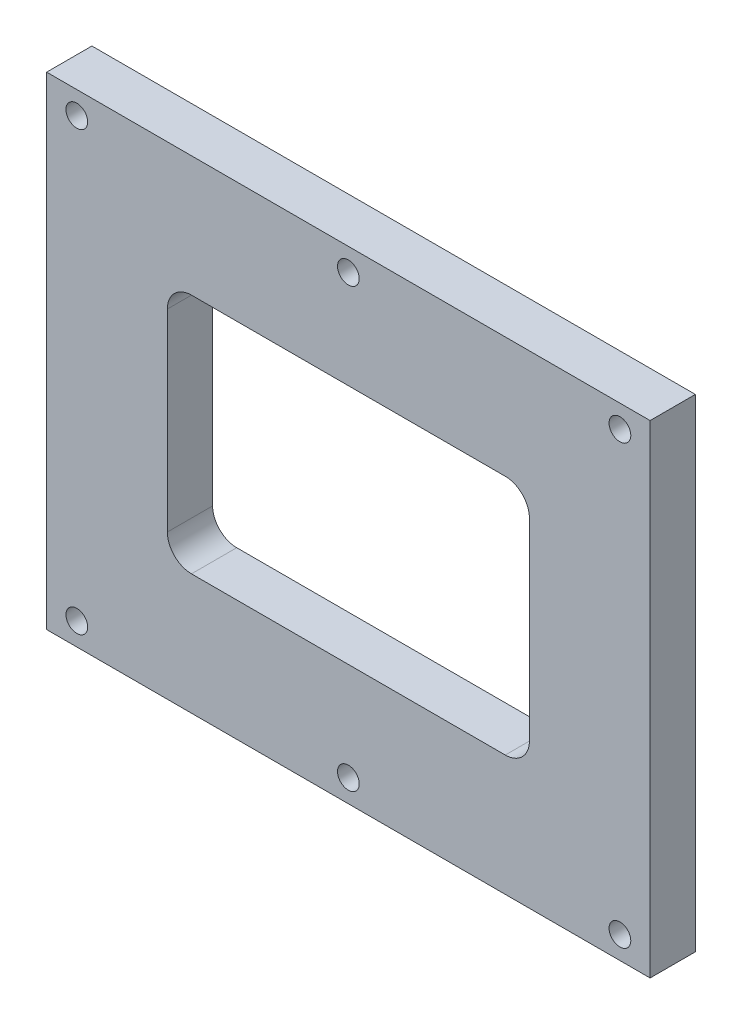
ISO-10303-21;
HEADER;
FILE_DESCRIPTION(('STEP AP214'),'2;1');
FILE_NAME('part.step','',(''),(''),'','','');
FILE_SCHEMA(('AUTOMOTIVE_DESIGN { 1 0 10303 214 1 1 1 1 }'));
ENDSEC;
DATA;
#1=APPLICATION_CONTEXT('core data for automotive mechanical design processes');
#2=APPLICATION_PROTOCOL_DEFINITION('international standard','automotive_design',2000,#1);
#3=PRODUCT_CONTEXT('',#1,'mechanical');
#4=PRODUCT('Part','Part','',(#3));
#5=PRODUCT_RELATED_PRODUCT_CATEGORY('part','',(#4));
#6=PRODUCT_DEFINITION_FORMATION('','',#4);
#7=PRODUCT_DEFINITION_CONTEXT('part definition',#1,'design');
#8=PRODUCT_DEFINITION('design','',#6,#7);
#9=PRODUCT_DEFINITION_SHAPE('','',#8);
#10=(LENGTH_UNIT() NAMED_UNIT(*) SI_UNIT(.MILLI.,.METRE.));
#11=(NAMED_UNIT(*) PLANE_ANGLE_UNIT() SI_UNIT($,.RADIAN.));
#12=(NAMED_UNIT(*) SI_UNIT($,.STERADIAN.) SOLID_ANGLE_UNIT());
#13=UNCERTAINTY_MEASURE_WITH_UNIT(LENGTH_MEASURE(1.E-05),#10,'distance_accuracy_value','');
#14=(GEOMETRIC_REPRESENTATION_CONTEXT(3) GLOBAL_UNCERTAINTY_ASSIGNED_CONTEXT((#13)) GLOBAL_UNIT_ASSIGNED_CONTEXT((#10,
#11,#12)) REPRESENTATION_CONTEXT('',''));
#15=CARTESIAN_POINT('',(0.,0.,0.));
#16=DIRECTION('',(0.,0.,1.));
#17=DIRECTION('',(1.,0.,0.));
#18=AXIS2_PLACEMENT_3D('',#15,#16,#17);
#19=CARTESIAN_POINT('',(31.75,-25.4,4.7625));
#20=DIRECTION('',(-1.,0.,0.));
#21=DIRECTION('',(0.,0.,1.));
#22=AXIS2_PLACEMENT_3D('',#19,#20,#21);
#23=PLANE('',#22);
#24=DIRECTION('',(0.,1.,0.));
#25=VECTOR('',#24,1.);
#26=CARTESIAN_POINT('',(31.75,-25.4,0.));
#27=LINE('',#26,#25);
#28=CARTESIAN_POINT('',(31.75,-25.4,0.));
#29=VERTEX_POINT('',#28);
#30=CARTESIAN_POINT('',(31.75,25.4,0.));
#31=VERTEX_POINT('',#30);
#32=EDGE_CURVE('E144',#29,#31,#27,.T.);
#33=ORIENTED_EDGE('',*,*,#32,.T.);
#34=DIRECTION('',(0.,0.,-1.));
#35=VECTOR('',#34,1.);
#36=CARTESIAN_POINT('',(31.75,25.4,4.7625));
#37=LINE('',#36,#35);
#38=CARTESIAN_POINT('',(31.75,25.4,4.7625));
#39=VERTEX_POINT('',#38);
#40=EDGE_CURVE('E125',#39,#31,#37,.T.);
#41=ORIENTED_EDGE('',*,*,#40,.F.);
#42=DIRECTION('',(0.,1.,0.));
#43=VECTOR('',#42,1.);
#44=CARTESIAN_POINT('',(31.75,-25.4,4.7625));
#45=LINE('',#44,#43);
#46=CARTESIAN_POINT('',(31.75,-25.4,4.7625));
#47=VERTEX_POINT('',#46);
#48=EDGE_CURVE('E132',#47,#39,#45,.T.);
#49=ORIENTED_EDGE('',*,*,#48,.F.);
#50=DIRECTION('',(0.,0.,-1.));
#51=VECTOR('',#50,1.);
#52=CARTESIAN_POINT('',(31.75,-25.4,4.7625));
#53=LINE('',#52,#51);
#54=EDGE_CURVE('E256',#47,#29,#53,.T.);
#55=ORIENTED_EDGE('',*,*,#54,.T.);
#56=EDGE_LOOP('',(#33,#41,#49,#55));
#57=FACE_BOUND('',#56,.T.);
#58=ADVANCED_FACE('F31',(#57),#23,.F.);
#59=CARTESIAN_POINT('',(-31.75,25.4,4.7625));
#60=DIRECTION('',(0.,-1.,0.));
#61=DIRECTION('',(0.,0.,-1.));
#62=AXIS2_PLACEMENT_3D('',#59,#60,#61);
#63=PLANE('',#62);
#64=DIRECTION('',(-1.,0.,0.));
#65=VECTOR('',#64,1.);
#66=CARTESIAN_POINT('',(-31.75,25.4,0.));
#67=LINE('',#66,#65);
#68=CARTESIAN_POINT('',(-31.75,25.4,0.));
#69=VERTEX_POINT('',#68);
#70=EDGE_CURVE('E258',#31,#69,#67,.T.);
#71=ORIENTED_EDGE('',*,*,#70,.T.);
#72=DIRECTION('',(0.,0.,-1.));
#73=VECTOR('',#72,1.);
#74=CARTESIAN_POINT('',(-31.75,25.4,4.7625));
#75=LINE('',#74,#73);
#76=CARTESIAN_POINT('',(-31.75,25.4,4.7625));
#77=VERTEX_POINT('',#76);
#78=EDGE_CURVE('E128',#77,#69,#75,.T.);
#79=ORIENTED_EDGE('',*,*,#78,.F.);
#80=DIRECTION('',(-1.,0.,0.));
#81=VECTOR('',#80,1.);
#82=CARTESIAN_POINT('',(-31.75,25.4,4.7625));
#83=LINE('',#82,#81);
#84=EDGE_CURVE('E121',#39,#77,#83,.T.);
#85=ORIENTED_EDGE('',*,*,#84,.F.);
#86=ORIENTED_EDGE('',*,*,#40,.T.);
#87=EDGE_LOOP('',(#71,#79,#85,#86));
#88=FACE_BOUND('',#87,.T.);
#89=ADVANCED_FACE('F123',(#88),#63,.F.);
#90=CARTESIAN_POINT('',(-31.75,-25.4,4.7625));
#91=DIRECTION('',(1.,0.,0.));
#92=DIRECTION('',(0.,0.,-1.));
#93=AXIS2_PLACEMENT_3D('',#90,#91,#92);
#94=PLANE('',#93);
#95=DIRECTION('',(0.,-1.,0.));
#96=VECTOR('',#95,1.);
#97=CARTESIAN_POINT('',(-31.75,-25.4,0.));
#98=LINE('',#97,#96);
#99=CARTESIAN_POINT('',(-31.75,-25.4,0.));
#100=VERTEX_POINT('',#99);
#101=EDGE_CURVE('E260',#69,#100,#98,.T.);
#102=ORIENTED_EDGE('',*,*,#101,.T.);
#103=DIRECTION('',(0.,0.,-1.));
#104=VECTOR('',#103,1.);
#105=CARTESIAN_POINT('',(-31.75,-25.4,4.7625));
#106=LINE('',#105,#104);
#107=CARTESIAN_POINT('',(-31.75,-25.4,4.7625));
#108=VERTEX_POINT('',#107);
#109=EDGE_CURVE('E149',#108,#100,#106,.T.);
#110=ORIENTED_EDGE('',*,*,#109,.F.);
#111=DIRECTION('',(0.,-1.,0.));
#112=VECTOR('',#111,1.);
#113=CARTESIAN_POINT('',(-31.75,-25.4,4.7625));
#114=LINE('',#113,#112);
#115=EDGE_CURVE('E131',#77,#108,#114,.T.);
#116=ORIENTED_EDGE('',*,*,#115,.F.);
#117=ORIENTED_EDGE('',*,*,#78,.T.);
#118=EDGE_LOOP('',(#102,#110,#116,#117));
#119=FACE_BOUND('',#118,.T.);
#120=ADVANCED_FACE('F271',(#119),#94,.F.);
#121=CARTESIAN_POINT('',(-31.75,-25.4,4.7625));
#122=DIRECTION('',(0.,1.,0.));
#123=DIRECTION('',(0.,0.,1.));
#124=AXIS2_PLACEMENT_3D('',#121,#122,#123);
#125=PLANE('',#124);
#126=DIRECTION('',(1.,0.,0.));
#127=VECTOR('',#126,1.);
#128=CARTESIAN_POINT('',(-31.75,-25.4,0.));
#129=LINE('',#128,#127);
#130=EDGE_CURVE('E141',#100,#29,#129,.T.);
#131=ORIENTED_EDGE('',*,*,#130,.T.);
#132=ORIENTED_EDGE('',*,*,#54,.F.);
#133=DIRECTION('',(1.,0.,0.));
#134=VECTOR('',#133,1.);
#135=CARTESIAN_POINT('',(-31.75,-25.4,4.7625));
#136=LINE('',#135,#134);
#137=EDGE_CURVE('E137',#108,#47,#136,.T.);
#138=ORIENTED_EDGE('',*,*,#137,.F.);
#139=ORIENTED_EDGE('',*,*,#109,.T.);
#140=EDGE_LOOP('',(#131,#132,#138,#139));
#141=FACE_BOUND('',#140,.T.);
#142=ADVANCED_FACE('F267',(#141),#125,.F.);
#143=CARTESIAN_POINT('',(31.75,25.4,4.7625));
#144=DIRECTION('',(0.,0.,-1.));
#145=DIRECTION('',(-1.,0.,0.));
#146=AXIS2_PLACEMENT_3D('',#143,#144,#145);
#147=PLANE('',#146);
#148=DIRECTION('',(0.,1.,0.));
#149=VECTOR('',#148,1.);
#150=CARTESIAN_POINT('',(19.05,-12.7,4.7625));
#151=LINE('',#150,#149);
#152=CARTESIAN_POINT('',(19.05,-10.16,4.7625));
#153=VERTEX_POINT('',#152);
#154=CARTESIAN_POINT('',(19.05,10.16,4.7625));
#155=VERTEX_POINT('',#154);
#156=EDGE_CURVE('E214',#153,#155,#151,.T.);
#157=ORIENTED_EDGE('',*,*,#156,.F.);
#158=CARTESIAN_POINT('',(16.51,-10.16,4.7625));
#159=DIRECTION('',(0.,0.,-1.));
#160=DIRECTION('',(-1.,0.,0.));
#161=AXIS2_PLACEMENT_3D('',#158,#159,#160);
#162=CIRCLE('',#161,2.54);
#163=CARTESIAN_POINT('',(16.51,-12.7,4.7625));
#164=VERTEX_POINT('',#163);
#165=EDGE_CURVE('E173',#153,#164,#162,.T.);
#166=ORIENTED_EDGE('',*,*,#165,.T.);
#167=DIRECTION('',(1.,0.,0.));
#168=VECTOR('',#167,1.);
#169=CARTESIAN_POINT('',(-19.05,-12.7,4.7625));
#170=LINE('',#169,#168);
#171=CARTESIAN_POINT('',(-16.51,-12.7,4.7625));
#172=VERTEX_POINT('',#171);
#173=EDGE_CURVE('E186',#172,#164,#170,.T.);
#174=ORIENTED_EDGE('',*,*,#173,.F.);
#175=CARTESIAN_POINT('',(-16.51,-10.16,4.7625));
#176=DIRECTION('',(0.,0.,-1.));
#177=DIRECTION('',(-1.,0.,0.));
#178=AXIS2_PLACEMENT_3D('',#175,#176,#177);
#179=CIRCLE('',#178,2.54);
#180=CARTESIAN_POINT('',(-19.05,-10.16,4.7625));
#181=VERTEX_POINT('',#180);
#182=EDGE_CURVE('E39',#172,#181,#179,.T.);
#183=ORIENTED_EDGE('',*,*,#182,.T.);
#184=DIRECTION('',(0.,-1.,0.));
#185=VECTOR('',#184,1.);
#186=CARTESIAN_POINT('',(-19.05,12.7,4.7625));
#187=LINE('',#186,#185);
#188=CARTESIAN_POINT('',(-19.05,10.16,4.7625));
#189=VERTEX_POINT('',#188);
#190=EDGE_CURVE('E184',#189,#181,#187,.T.);
#191=ORIENTED_EDGE('',*,*,#190,.F.);
#192=CARTESIAN_POINT('',(-16.51,10.16,4.7625));
#193=DIRECTION('',(0.,0.,-1.));
#194=DIRECTION('',(-1.,0.,0.));
#195=AXIS2_PLACEMENT_3D('',#192,#193,#194);
#196=CIRCLE('',#195,2.54);
#197=CARTESIAN_POINT('',(-16.51,12.7,4.7625));
#198=VERTEX_POINT('',#197);
#199=EDGE_CURVE('E177',#189,#198,#196,.T.);
#200=ORIENTED_EDGE('',*,*,#199,.T.);
#201=DIRECTION('',(-1.,0.,0.));
#202=VECTOR('',#201,1.);
#203=CARTESIAN_POINT('',(19.05,12.7,4.7625));
#204=LINE('',#203,#202);
#205=CARTESIAN_POINT('',(16.51,12.7,4.7625));
#206=VERTEX_POINT('',#205);
#207=EDGE_CURVE('E192',#206,#198,#204,.T.);
#208=ORIENTED_EDGE('',*,*,#207,.F.);
#209=CARTESIAN_POINT('',(16.51,10.16,4.7625));
#210=DIRECTION('',(0.,0.,-1.));
#211=DIRECTION('',(-1.,0.,0.));
#212=AXIS2_PLACEMENT_3D('',#209,#210,#211);
#213=CIRCLE('',#212,2.54);
#214=EDGE_CURVE('E169',#206,#155,#213,.T.);
#215=ORIENTED_EDGE('',*,*,#214,.T.);
#216=EDGE_LOOP('',(#157,#166,#174,#183,#191,#200,#208,#215));
#217=FACE_BOUND('',#216,.T.);
#218=CARTESIAN_POINT('',(-28.575,23.01875,4.7625));
#219=DIRECTION('',(0.,0.,1.));
#220=DIRECTION('',(-1.,0.,0.));
#221=AXIS2_PLACEMENT_3D('',#218,#219,#220);
#222=CIRCLE('',#221,1.143);
#223=CARTESIAN_POINT('',(-27.432,23.01875,4.7625));
#224=VERTEX_POINT('',#223);
#225=EDGE_CURVE('E212',#224,#224,#222,.T.);
#226=ORIENTED_EDGE('',*,*,#225,.F.);
#227=EDGE_LOOP('',(#226));
#228=FACE_BOUND('',#227,.T.);
#229=CARTESIAN_POINT('',(28.575,23.01875,4.7625));
#230=DIRECTION('',(0.,0.,1.));
#231=DIRECTION('',(1.,0.,0.));
#232=AXIS2_PLACEMENT_3D('',#229,#230,#231);
#233=CIRCLE('',#232,1.143);
#234=CARTESIAN_POINT('',(29.718,23.01875,4.7625));
#235=VERTEX_POINT('',#234);
#236=EDGE_CURVE('E222',#235,#235,#233,.T.);
#237=ORIENTED_EDGE('',*,*,#236,.F.);
#238=EDGE_LOOP('',(#237));
#239=FACE_BOUND('',#238,.T.);
#240=CARTESIAN_POINT('',(0.,23.01875,4.7625));
#241=DIRECTION('',(0.,0.,1.));
#242=DIRECTION('',(-1.,0.,0.));
#243=AXIS2_PLACEMENT_3D('',#240,#241,#242);
#244=CIRCLE('',#243,1.143);
#245=CARTESIAN_POINT('',(1.14300000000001,23.01875,4.7625));
#246=VERTEX_POINT('',#245);
#247=EDGE_CURVE('E228',#246,#246,#244,.T.);
#248=ORIENTED_EDGE('',*,*,#247,.F.);
#249=EDGE_LOOP('',(#248));
#250=FACE_BOUND('',#249,.T.);
#251=CARTESIAN_POINT('',(0.,-23.01875,4.7625));
#252=DIRECTION('',(0.,0.,1.));
#253=DIRECTION('',(1.,0.,0.));
#254=AXIS2_PLACEMENT_3D('',#251,#252,#253);
#255=CIRCLE('',#254,1.143);
#256=CARTESIAN_POINT('',(1.14300000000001,-23.01875,4.7625));
#257=VERTEX_POINT('',#256);
#258=EDGE_CURVE('E234',#257,#257,#255,.T.);
#259=ORIENTED_EDGE('',*,*,#258,.F.);
#260=EDGE_LOOP('',(#259));
#261=FACE_BOUND('',#260,.T.);
#262=CARTESIAN_POINT('',(28.575,-23.01875,4.7625));
#263=DIRECTION('',(0.,0.,1.));
#264=DIRECTION('',(-1.,0.,0.));
#265=AXIS2_PLACEMENT_3D('',#262,#263,#264);
#266=CIRCLE('',#265,1.143);
#267=CARTESIAN_POINT('',(29.718,-23.01875,4.7625));
#268=VERTEX_POINT('',#267);
#269=EDGE_CURVE('E240',#268,#268,#266,.T.);
#270=ORIENTED_EDGE('',*,*,#269,.F.);
#271=EDGE_LOOP('',(#270));
#272=FACE_BOUND('',#271,.T.);
#273=CARTESIAN_POINT('',(-28.575,-23.01875,4.7625));
#274=DIRECTION('',(0.,0.,1.));
#275=DIRECTION('',(1.,0.,0.));
#276=AXIS2_PLACEMENT_3D('',#273,#274,#275);
#277=CIRCLE('',#276,1.143);
#278=CARTESIAN_POINT('',(-27.432,-23.01875,4.7625));
#279=VERTEX_POINT('',#278);
#280=EDGE_CURVE('E246',#279,#279,#277,.T.);
#281=ORIENTED_EDGE('',*,*,#280,.F.);
#282=EDGE_LOOP('',(#281));
#283=FACE_BOUND('',#282,.T.);
#284=ORIENTED_EDGE('',*,*,#48,.T.);
#285=ORIENTED_EDGE('',*,*,#84,.T.);
#286=ORIENTED_EDGE('',*,*,#115,.T.);
#287=ORIENTED_EDGE('',*,*,#137,.T.);
#288=EDGE_LOOP('',(#284,#285,#286,#287));
#289=FACE_BOUND('',#288,.T.);
#290=ADVANCED_FACE('F135',(#217,#228,#239,#250,#261,#272,#283,#289),#147,.F.);
#291=CARTESIAN_POINT('',(31.75,25.4,0.));
#292=DIRECTION('',(0.,0.,-1.));
#293=DIRECTION('',(-1.,0.,0.));
#294=AXIS2_PLACEMENT_3D('',#291,#292,#293);
#295=PLANE('',#294);
#296=DIRECTION('',(0.,-1.,0.));
#297=VECTOR('',#296,1.);
#298=CARTESIAN_POINT('',(-19.05,12.7,0.));
#299=LINE('',#298,#297);
#300=CARTESIAN_POINT('',(-19.05,10.16,0.));
#301=VERTEX_POINT('',#300);
#302=CARTESIAN_POINT('',(-19.05,-10.16,0.));
#303=VERTEX_POINT('',#302);
#304=EDGE_CURVE('E200',#301,#303,#299,.T.);
#305=ORIENTED_EDGE('',*,*,#304,.T.);
#306=CARTESIAN_POINT('',(-16.51,-10.16,0.));
#307=DIRECTION('',(0.,0.,-1.));
#308=DIRECTION('',(-1.,0.,0.));
#309=AXIS2_PLACEMENT_3D('',#306,#307,#308);
#310=CIRCLE('',#309,2.54);
#311=CARTESIAN_POINT('',(-16.51,-12.7,0.));
#312=VERTEX_POINT('',#311);
#313=EDGE_CURVE('E11',#303,#312,#310,.F.);
#314=ORIENTED_EDGE('',*,*,#313,.T.);
#315=DIRECTION('',(1.,0.,0.));
#316=VECTOR('',#315,1.);
#317=CARTESIAN_POINT('',(-19.05,-12.7,0.));
#318=LINE('',#317,#316);
#319=CARTESIAN_POINT('',(16.51,-12.7,0.));
#320=VERTEX_POINT('',#319);
#321=EDGE_CURVE('E191',#312,#320,#318,.T.);
#322=ORIENTED_EDGE('',*,*,#321,.T.);
#323=CARTESIAN_POINT('',(16.51,-10.16,0.));
#324=DIRECTION('',(0.,0.,-1.));
#325=DIRECTION('',(-1.,0.,0.));
#326=AXIS2_PLACEMENT_3D('',#323,#324,#325);
#327=CIRCLE('',#326,2.54);
#328=CARTESIAN_POINT('',(19.05,-10.16,0.));
#329=VERTEX_POINT('',#328);
#330=EDGE_CURVE('E175',#320,#329,#327,.F.);
#331=ORIENTED_EDGE('',*,*,#330,.T.);
#332=DIRECTION('',(0.,1.,0.));
#333=VECTOR('',#332,1.);
#334=CARTESIAN_POINT('',(19.05,-12.7,0.));
#335=LINE('',#334,#333);
#336=CARTESIAN_POINT('',(19.05,10.16,0.));
#337=VERTEX_POINT('',#336);
#338=EDGE_CURVE('E204',#329,#337,#335,.T.);
#339=ORIENTED_EDGE('',*,*,#338,.T.);
#340=CARTESIAN_POINT('',(16.51,10.16,0.));
#341=DIRECTION('',(0.,0.,-1.));
#342=DIRECTION('',(-1.,0.,0.));
#343=AXIS2_PLACEMENT_3D('',#340,#341,#342);
#344=CIRCLE('',#343,2.54);
#345=CARTESIAN_POINT('',(16.51,12.7,0.));
#346=VERTEX_POINT('',#345);
#347=EDGE_CURVE('E171',#337,#346,#344,.F.);
#348=ORIENTED_EDGE('',*,*,#347,.T.);
#349=DIRECTION('',(-1.,0.,0.));
#350=VECTOR('',#349,1.);
#351=CARTESIAN_POINT('',(19.05,12.7,0.));
#352=LINE('',#351,#350);
#353=CARTESIAN_POINT('',(-16.51,12.7,0.));
#354=VERTEX_POINT('',#353);
#355=EDGE_CURVE('E207',#346,#354,#352,.T.);
#356=ORIENTED_EDGE('',*,*,#355,.T.);
#357=CARTESIAN_POINT('',(-16.51,10.16,0.));
#358=DIRECTION('',(0.,0.,-1.));
#359=DIRECTION('',(-1.,0.,0.));
#360=AXIS2_PLACEMENT_3D('',#357,#358,#359);
#361=CIRCLE('',#360,2.54);
#362=EDGE_CURVE('E53',#354,#301,#361,.F.);
#363=ORIENTED_EDGE('',*,*,#362,.T.);
#364=EDGE_LOOP('',(#305,#314,#322,#331,#339,#348,#356,#363));
#365=FACE_BOUND('',#364,.T.);
#366=CARTESIAN_POINT('',(-28.575,23.01875,0.));
#367=DIRECTION('',(0.,0.,1.));
#368=DIRECTION('',(-1.,0.,0.));
#369=AXIS2_PLACEMENT_3D('',#366,#367,#368);
#370=CIRCLE('',#369,1.143);
#371=CARTESIAN_POINT('',(-27.432,23.01875,0.));
#372=VERTEX_POINT('',#371);
#373=EDGE_CURVE('E219',#372,#372,#370,.T.);
#374=ORIENTED_EDGE('',*,*,#373,.T.);
#375=EDGE_LOOP('',(#374));
#376=FACE_BOUND('',#375,.T.);
#377=CARTESIAN_POINT('',(28.575,23.01875,0.));
#378=DIRECTION('',(0.,0.,1.));
#379=DIRECTION('',(1.,0.,0.));
#380=AXIS2_PLACEMENT_3D('',#377,#378,#379);
#381=CIRCLE('',#380,1.143);
#382=CARTESIAN_POINT('',(29.718,23.01875,0.));
#383=VERTEX_POINT('',#382);
#384=EDGE_CURVE('E225',#383,#383,#381,.T.);
#385=ORIENTED_EDGE('',*,*,#384,.T.);
#386=EDGE_LOOP('',(#385));
#387=FACE_BOUND('',#386,.T.);
#388=CARTESIAN_POINT('',(0.,23.01875,0.));
#389=DIRECTION('',(0.,0.,1.));
#390=DIRECTION('',(-1.,0.,0.));
#391=AXIS2_PLACEMENT_3D('',#388,#389,#390);
#392=CIRCLE('',#391,1.143);
#393=CARTESIAN_POINT('',(1.14300000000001,23.01875,0.));
#394=VERTEX_POINT('',#393);
#395=EDGE_CURVE('E231',#394,#394,#392,.T.);
#396=ORIENTED_EDGE('',*,*,#395,.T.);
#397=EDGE_LOOP('',(#396));
#398=FACE_BOUND('',#397,.T.);
#399=CARTESIAN_POINT('',(0.,-23.01875,0.));
#400=DIRECTION('',(0.,0.,1.));
#401=DIRECTION('',(1.,0.,0.));
#402=AXIS2_PLACEMENT_3D('',#399,#400,#401);
#403=CIRCLE('',#402,1.143);
#404=CARTESIAN_POINT('',(1.14300000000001,-23.01875,0.));
#405=VERTEX_POINT('',#404);
#406=EDGE_CURVE('E237',#405,#405,#403,.T.);
#407=ORIENTED_EDGE('',*,*,#406,.T.);
#408=EDGE_LOOP('',(#407));
#409=FACE_BOUND('',#408,.T.);
#410=CARTESIAN_POINT('',(28.575,-23.01875,0.));
#411=DIRECTION('',(0.,0.,1.));
#412=DIRECTION('',(-1.,0.,0.));
#413=AXIS2_PLACEMENT_3D('',#410,#411,#412);
#414=CIRCLE('',#413,1.143);
#415=CARTESIAN_POINT('',(29.718,-23.01875,0.));
#416=VERTEX_POINT('',#415);
#417=EDGE_CURVE('E243',#416,#416,#414,.T.);
#418=ORIENTED_EDGE('',*,*,#417,.T.);
#419=EDGE_LOOP('',(#418));
#420=FACE_BOUND('',#419,.T.);
#421=CARTESIAN_POINT('',(-28.575,-23.01875,0.));
#422=DIRECTION('',(0.,0.,1.));
#423=DIRECTION('',(1.,0.,0.));
#424=AXIS2_PLACEMENT_3D('',#421,#422,#423);
#425=CIRCLE('',#424,1.143);
#426=CARTESIAN_POINT('',(-27.432,-23.01875,0.));
#427=VERTEX_POINT('',#426);
#428=EDGE_CURVE('E249',#427,#427,#425,.T.);
#429=ORIENTED_EDGE('',*,*,#428,.T.);
#430=EDGE_LOOP('',(#429));
#431=FACE_BOUND('',#430,.T.);
#432=ORIENTED_EDGE('',*,*,#32,.F.);
#433=ORIENTED_EDGE('',*,*,#130,.F.);
#434=ORIENTED_EDGE('',*,*,#101,.F.);
#435=ORIENTED_EDGE('',*,*,#70,.F.);
#436=EDGE_LOOP('',(#432,#433,#434,#435));
#437=FACE_BOUND('',#436,.T.);
#438=ADVANCED_FACE('F197',(#365,#376,#387,#398,#409,#420,#431,#437),#295,.T.);
#439=CARTESIAN_POINT('',(-28.575,-23.01875,0.));
#440=DIRECTION('',(0.,0.,1.));
#441=DIRECTION('',(1.,0.,0.));
#442=AXIS2_PLACEMENT_3D('',#439,#440,#441);
#443=CYLINDRICAL_SURFACE('',#442,1.143);
#444=CARTESIAN_POINT('',(-27.432,-23.01875,0.));
#445=CARTESIAN_POINT('',(-27.432,-23.01875,0.049609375));
#446=CARTESIAN_POINT('',(-27.432,-23.01875,0.09921875));
#447=CARTESIAN_POINT('',(-27.432,-23.01875,0.1984375));
#448=CARTESIAN_POINT('',(-27.432,-23.01875,0.248046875));
#449=CARTESIAN_POINT('',(-27.432,-23.01875,0.347265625));
#450=CARTESIAN_POINT('',(-27.432,-23.01875,0.396875));
#451=CARTESIAN_POINT('',(-27.432,-23.01875,0.49609375));
#452=CARTESIAN_POINT('',(-27.432,-23.01875,0.545703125));
#453=CARTESIAN_POINT('',(-27.432,-23.01875,0.644921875));
#454=CARTESIAN_POINT('',(-27.432,-23.01875,0.69453125));
#455=CARTESIAN_POINT('',(-27.432,-23.01875,0.79375));
#456=CARTESIAN_POINT('',(-27.432,-23.01875,0.843359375));
#457=CARTESIAN_POINT('',(-27.432,-23.01875,0.942578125));
#458=CARTESIAN_POINT('',(-27.432,-23.01875,0.9921875));
#459=CARTESIAN_POINT('',(-27.432,-23.01875,1.09140625));
#460=CARTESIAN_POINT('',(-27.432,-23.01875,1.141015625));
#461=CARTESIAN_POINT('',(-27.432,-23.01875,1.240234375));
#462=CARTESIAN_POINT('',(-27.432,-23.01875,1.28984375));
#463=CARTESIAN_POINT('',(-27.432,-23.01875,1.3890625));
#464=CARTESIAN_POINT('',(-27.432,-23.01875,1.438671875));
#465=CARTESIAN_POINT('',(-27.432,-23.01875,1.537890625));
#466=CARTESIAN_POINT('',(-27.432,-23.01875,1.5875));
#467=CARTESIAN_POINT('',(-27.432,-23.01875,1.68671875));
#468=CARTESIAN_POINT('',(-27.432,-23.01875,1.736328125));
#469=CARTESIAN_POINT('',(-27.432,-23.01875,1.835546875));
#470=CARTESIAN_POINT('',(-27.432,-23.01875,1.88515625));
#471=CARTESIAN_POINT('',(-27.432,-23.01875,1.984375));
#472=CARTESIAN_POINT('',(-27.432,-23.01875,2.033984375));
#473=CARTESIAN_POINT('',(-27.432,-23.01875,2.133203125));
#474=CARTESIAN_POINT('',(-27.432,-23.01875,2.1828125));
#475=CARTESIAN_POINT('',(-27.432,-23.01875,2.28203125));
#476=CARTESIAN_POINT('',(-27.432,-23.01875,2.331640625));
#477=CARTESIAN_POINT('',(-27.432,-23.01875,2.430859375));
#478=CARTESIAN_POINT('',(-27.432,-23.01875,2.48046875));
#479=CARTESIAN_POINT('',(-27.432,-23.01875,2.5796875));
#480=CARTESIAN_POINT('',(-27.432,-23.01875,2.629296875));
#481=CARTESIAN_POINT('',(-27.432,-23.01875,2.728515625));
#482=CARTESIAN_POINT('',(-27.432,-23.01875,2.778125));
#483=CARTESIAN_POINT('',(-27.432,-23.01875,2.87734375));
#484=CARTESIAN_POINT('',(-27.432,-23.01875,2.926953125));
#485=CARTESIAN_POINT('',(-27.432,-23.01875,3.026171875));
#486=CARTESIAN_POINT('',(-27.432,-23.01875,3.07578125));
#487=CARTESIAN_POINT('',(-27.432,-23.01875,3.175));
#488=CARTESIAN_POINT('',(-27.432,-23.01875,3.224609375));
#489=CARTESIAN_POINT('',(-27.432,-23.01875,3.323828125));
#490=CARTESIAN_POINT('',(-27.432,-23.01875,3.3734375));
#491=CARTESIAN_POINT('',(-27.432,-23.01875,3.47265625));
#492=CARTESIAN_POINT('',(-27.432,-23.01875,3.522265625));
#493=CARTESIAN_POINT('',(-27.432,-23.01875,3.621484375));
#494=CARTESIAN_POINT('',(-27.432,-23.01875,3.67109375));
#495=CARTESIAN_POINT('',(-27.432,-23.01875,3.7703125));
#496=CARTESIAN_POINT('',(-27.432,-23.01875,3.819921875));
#497=CARTESIAN_POINT('',(-27.432,-23.01875,3.919140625));
#498=CARTESIAN_POINT('',(-27.432,-23.01875,3.96875));
#499=CARTESIAN_POINT('',(-27.432,-23.01875,4.06796875));
#500=CARTESIAN_POINT('',(-27.432,-23.01875,4.117578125));
#501=CARTESIAN_POINT('',(-27.432,-23.01875,4.216796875));
#502=CARTESIAN_POINT('',(-27.432,-23.01875,4.26640625));
#503=CARTESIAN_POINT('',(-27.432,-23.01875,4.365625));
#504=CARTESIAN_POINT('',(-27.432,-23.01875,4.415234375));
#505=CARTESIAN_POINT('',(-27.432,-23.01875,4.514453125));
#506=CARTESIAN_POINT('',(-27.432,-23.01875,4.5640625));
#507=CARTESIAN_POINT('',(-27.432,-23.01875,4.66328125));
#508=CARTESIAN_POINT('',(-27.432,-23.01875,4.712890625));
#509=CARTESIAN_POINT('',(-27.432,-23.01875,4.7625));
#510=B_SPLINE_CURVE_WITH_KNOTS('',3,(#444,#445,#446,#447,#448,#449,#450,#451,#452,#453,#454,
#455,#456,#457,#458,#459,#460,#461,#462,#463,#464,#465,#466,#467,#468,#469,#470,#471,#472,#473,
#474,#475,#476,#477,#478,#479,#480,#481,#482,#483,#484,#485,#486,#487,#488,#489,#490,#491,#492,
#493,#494,#495,#496,#497,#498,#499,#500,#501,#502,#503,#504,#505,#506,#507,#508,#509),
.UNSPECIFIED.,.F.,.F.,(4,2,2,2,2,2,2,2,2,2,2,2,2,2,2,2,2,2,2,2,2,2,2,2,2,2,2,2,2,2,2,2,4),(0.,
0.148828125,0.29765625,0.446484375,0.5953125,0.744140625,0.89296875,1.041796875,1.190625,
1.339453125,1.48828125,1.637109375,1.7859375,1.934765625,2.08359375,2.232421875,2.38125,
2.530078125,2.67890625,2.827734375,2.9765625,3.125390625,3.27421875,3.423046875,3.571875,
3.720703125,3.86953125,4.018359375,4.1671875,4.316015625,4.46484375,4.613671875,4.7625),.UNSPECIFIED.);
#511=EDGE_CURVE('BSEAM339',#427,#279,#510,.T.);
#512=ORIENTED_EDGE('',*,*,#428,.F.);
#513=ORIENTED_EDGE('',*,*,#280,.T.);
#514=ORIENTED_EDGE('',*,*,#511,.T.);
#515=ORIENTED_EDGE('',*,*,#511,.F.);
#516=EDGE_LOOP('',(#512,#514,#513,#515));
#517=FACE_BOUND('',#516,.T.);
#518=ADVANCED_FACE('F339',(#517),#443,.F.);
#519=CARTESIAN_POINT('',(28.575,-23.01875,0.));
#520=DIRECTION('',(0.,0.,1.));
#521=DIRECTION('',(1.,0.,0.));
#522=AXIS2_PLACEMENT_3D('',#519,#520,#521);
#523=CYLINDRICAL_SURFACE('',#522,1.143);
#524=CARTESIAN_POINT('',(29.718,-23.01875,0.));
#525=CARTESIAN_POINT('',(29.718,-23.01875,0.049609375));
#526=CARTESIAN_POINT('',(29.718,-23.01875,0.09921875));
#527=CARTESIAN_POINT('',(29.718,-23.01875,0.1984375));
#528=CARTESIAN_POINT('',(29.718,-23.01875,0.248046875));
#529=CARTESIAN_POINT('',(29.718,-23.01875,0.347265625));
#530=CARTESIAN_POINT('',(29.718,-23.01875,0.396875));
#531=CARTESIAN_POINT('',(29.718,-23.01875,0.49609375));
#532=CARTESIAN_POINT('',(29.718,-23.01875,0.545703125));
#533=CARTESIAN_POINT('',(29.718,-23.01875,0.644921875));
#534=CARTESIAN_POINT('',(29.718,-23.01875,0.69453125));
#535=CARTESIAN_POINT('',(29.718,-23.01875,0.79375));
#536=CARTESIAN_POINT('',(29.718,-23.01875,0.843359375));
#537=CARTESIAN_POINT('',(29.718,-23.01875,0.942578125));
#538=CARTESIAN_POINT('',(29.718,-23.01875,0.9921875));
#539=CARTESIAN_POINT('',(29.718,-23.01875,1.09140625));
#540=CARTESIAN_POINT('',(29.718,-23.01875,1.141015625));
#541=CARTESIAN_POINT('',(29.718,-23.01875,1.240234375));
#542=CARTESIAN_POINT('',(29.718,-23.01875,1.28984375));
#543=CARTESIAN_POINT('',(29.718,-23.01875,1.3890625));
#544=CARTESIAN_POINT('',(29.718,-23.01875,1.438671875));
#545=CARTESIAN_POINT('',(29.718,-23.01875,1.537890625));
#546=CARTESIAN_POINT('',(29.718,-23.01875,1.5875));
#547=CARTESIAN_POINT('',(29.718,-23.01875,1.68671875));
#548=CARTESIAN_POINT('',(29.718,-23.01875,1.736328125));
#549=CARTESIAN_POINT('',(29.718,-23.01875,1.835546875));
#550=CARTESIAN_POINT('',(29.718,-23.01875,1.88515625));
#551=CARTESIAN_POINT('',(29.718,-23.01875,1.984375));
#552=CARTESIAN_POINT('',(29.718,-23.01875,2.033984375));
#553=CARTESIAN_POINT('',(29.718,-23.01875,2.133203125));
#554=CARTESIAN_POINT('',(29.718,-23.01875,2.1828125));
#555=CARTESIAN_POINT('',(29.718,-23.01875,2.28203125));
#556=CARTESIAN_POINT('',(29.718,-23.01875,2.331640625));
#557=CARTESIAN_POINT('',(29.718,-23.01875,2.430859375));
#558=CARTESIAN_POINT('',(29.718,-23.01875,2.48046875));
#559=CARTESIAN_POINT('',(29.718,-23.01875,2.5796875));
#560=CARTESIAN_POINT('',(29.718,-23.01875,2.629296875));
#561=CARTESIAN_POINT('',(29.718,-23.01875,2.728515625));
#562=CARTESIAN_POINT('',(29.718,-23.01875,2.778125));
#563=CARTESIAN_POINT('',(29.718,-23.01875,2.87734375));
#564=CARTESIAN_POINT('',(29.718,-23.01875,2.926953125));
#565=CARTESIAN_POINT('',(29.718,-23.01875,3.026171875));
#566=CARTESIAN_POINT('',(29.718,-23.01875,3.07578125));
#567=CARTESIAN_POINT('',(29.718,-23.01875,3.175));
#568=CARTESIAN_POINT('',(29.718,-23.01875,3.224609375));
#569=CARTESIAN_POINT('',(29.718,-23.01875,3.323828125));
#570=CARTESIAN_POINT('',(29.718,-23.01875,3.3734375));
#571=CARTESIAN_POINT('',(29.718,-23.01875,3.47265625));
#572=CARTESIAN_POINT('',(29.718,-23.01875,3.522265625));
#573=CARTESIAN_POINT('',(29.718,-23.01875,3.621484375));
#574=CARTESIAN_POINT('',(29.718,-23.01875,3.67109375));
#575=CARTESIAN_POINT('',(29.718,-23.01875,3.7703125));
#576=CARTESIAN_POINT('',(29.718,-23.01875,3.819921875));
#577=CARTESIAN_POINT('',(29.718,-23.01875,3.919140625));
#578=CARTESIAN_POINT('',(29.718,-23.01875,3.96875));
#579=CARTESIAN_POINT('',(29.718,-23.01875,4.06796875));
#580=CARTESIAN_POINT('',(29.718,-23.01875,4.117578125));
#581=CARTESIAN_POINT('',(29.718,-23.01875,4.216796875));
#582=CARTESIAN_POINT('',(29.718,-23.01875,4.26640625));
#583=CARTESIAN_POINT('',(29.718,-23.01875,4.365625));
#584=CARTESIAN_POINT('',(29.718,-23.01875,4.415234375));
#585=CARTESIAN_POINT('',(29.718,-23.01875,4.514453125));
#586=CARTESIAN_POINT('',(29.718,-23.01875,4.5640625));
#587=CARTESIAN_POINT('',(29.718,-23.01875,4.66328125));
#588=CARTESIAN_POINT('',(29.718,-23.01875,4.712890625));
#589=CARTESIAN_POINT('',(29.718,-23.01875,4.7625));
#590=B_SPLINE_CURVE_WITH_KNOTS('',3,(#524,#525,#526,#527,#528,#529,#530,#531,#532,#533,#534,
#535,#536,#537,#538,#539,#540,#541,#542,#543,#544,#545,#546,#547,#548,#549,#550,#551,#552,#553,
#554,#555,#556,#557,#558,#559,#560,#561,#562,#563,#564,#565,#566,#567,#568,#569,#570,#571,#572,
#573,#574,#575,#576,#577,#578,#579,#580,#581,#582,#583,#584,#585,#586,#587,#588,#589),
.UNSPECIFIED.,.F.,.F.,(4,2,2,2,2,2,2,2,2,2,2,2,2,2,2,2,2,2,2,2,2,2,2,2,2,2,2,2,2,2,2,2,4),(0.,
0.148828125,0.29765625,0.446484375,0.5953125,0.744140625,0.89296875,1.041796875,1.190625,
1.339453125,1.48828125,1.637109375,1.7859375,1.934765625,2.08359375,2.232421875,2.38125,
2.530078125,2.67890625,2.827734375,2.9765625,3.125390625,3.27421875,3.423046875,3.571875,
3.720703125,3.86953125,4.018359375,4.1671875,4.316015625,4.46484375,4.613671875,4.7625),.UNSPECIFIED.);
#591=EDGE_CURVE('BSEAM335',#416,#268,#590,.T.);
#592=ORIENTED_EDGE('',*,*,#417,.F.);
#593=ORIENTED_EDGE('',*,*,#269,.T.);
#594=ORIENTED_EDGE('',*,*,#591,.T.);
#595=ORIENTED_EDGE('',*,*,#591,.F.);
#596=EDGE_LOOP('',(#592,#594,#593,#595));
#597=FACE_BOUND('',#596,.T.);
#598=ADVANCED_FACE('F335',(#597),#523,.F.);
#599=CARTESIAN_POINT('',(0.,-23.01875,0.));
#600=DIRECTION('',(0.,0.,1.));
#601=DIRECTION('',(1.,0.,0.));
#602=AXIS2_PLACEMENT_3D('',#599,#600,#601);
#603=CYLINDRICAL_SURFACE('',#602,1.143);
#604=CARTESIAN_POINT('',(1.14300000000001,-23.01875,0.));
#605=CARTESIAN_POINT('',(1.14300000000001,-23.01875,0.049609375));
#606=CARTESIAN_POINT('',(1.14300000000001,-23.01875,0.09921875));
#607=CARTESIAN_POINT('',(1.14300000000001,-23.01875,0.1984375));
#608=CARTESIAN_POINT('',(1.14300000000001,-23.01875,0.248046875));
#609=CARTESIAN_POINT('',(1.14300000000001,-23.01875,0.347265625));
#610=CARTESIAN_POINT('',(1.14300000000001,-23.01875,0.396875));
#611=CARTESIAN_POINT('',(1.14300000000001,-23.01875,0.49609375));
#612=CARTESIAN_POINT('',(1.14300000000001,-23.01875,0.545703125));
#613=CARTESIAN_POINT('',(1.14300000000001,-23.01875,0.644921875));
#614=CARTESIAN_POINT('',(1.14300000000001,-23.01875,0.69453125));
#615=CARTESIAN_POINT('',(1.14300000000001,-23.01875,0.79375));
#616=CARTESIAN_POINT('',(1.14300000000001,-23.01875,0.843359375));
#617=CARTESIAN_POINT('',(1.14300000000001,-23.01875,0.942578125));
#618=CARTESIAN_POINT('',(1.14300000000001,-23.01875,0.9921875));
#619=CARTESIAN_POINT('',(1.14300000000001,-23.01875,1.09140625));
#620=CARTESIAN_POINT('',(1.14300000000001,-23.01875,1.141015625));
#621=CARTESIAN_POINT('',(1.14300000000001,-23.01875,1.240234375));
#622=CARTESIAN_POINT('',(1.14300000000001,-23.01875,1.28984375));
#623=CARTESIAN_POINT('',(1.14300000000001,-23.01875,1.3890625));
#624=CARTESIAN_POINT('',(1.14300000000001,-23.01875,1.438671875));
#625=CARTESIAN_POINT('',(1.14300000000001,-23.01875,1.537890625));
#626=CARTESIAN_POINT('',(1.14300000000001,-23.01875,1.5875));
#627=CARTESIAN_POINT('',(1.14300000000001,-23.01875,1.68671875));
#628=CARTESIAN_POINT('',(1.14300000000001,-23.01875,1.736328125));
#629=CARTESIAN_POINT('',(1.14300000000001,-23.01875,1.835546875));
#630=CARTESIAN_POINT('',(1.14300000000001,-23.01875,1.88515625));
#631=CARTESIAN_POINT('',(1.14300000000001,-23.01875,1.984375));
#632=CARTESIAN_POINT('',(1.14300000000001,-23.01875,2.033984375));
#633=CARTESIAN_POINT('',(1.14300000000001,-23.01875,2.133203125));
#634=CARTESIAN_POINT('',(1.14300000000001,-23.01875,2.1828125));
#635=CARTESIAN_POINT('',(1.14300000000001,-23.01875,2.28203125));
#636=CARTESIAN_POINT('',(1.14300000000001,-23.01875,2.331640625));
#637=CARTESIAN_POINT('',(1.14300000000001,-23.01875,2.430859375));
#638=CARTESIAN_POINT('',(1.14300000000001,-23.01875,2.48046875));
#639=CARTESIAN_POINT('',(1.14300000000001,-23.01875,2.5796875));
#640=CARTESIAN_POINT('',(1.14300000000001,-23.01875,2.629296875));
#641=CARTESIAN_POINT('',(1.14300000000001,-23.01875,2.728515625));
#642=CARTESIAN_POINT('',(1.14300000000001,-23.01875,2.778125));
#643=CARTESIAN_POINT('',(1.14300000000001,-23.01875,2.87734375));
#644=CARTESIAN_POINT('',(1.14300000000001,-23.01875,2.926953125));
#645=CARTESIAN_POINT('',(1.14300000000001,-23.01875,3.026171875));
#646=CARTESIAN_POINT('',(1.14300000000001,-23.01875,3.07578125));
#647=CARTESIAN_POINT('',(1.14300000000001,-23.01875,3.175));
#648=CARTESIAN_POINT('',(1.14300000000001,-23.01875,3.224609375));
#649=CARTESIAN_POINT('',(1.14300000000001,-23.01875,3.323828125));
#650=CARTESIAN_POINT('',(1.14300000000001,-23.01875,3.3734375));
#651=CARTESIAN_POINT('',(1.14300000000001,-23.01875,3.47265625));
#652=CARTESIAN_POINT('',(1.14300000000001,-23.01875,3.522265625));
#653=CARTESIAN_POINT('',(1.14300000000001,-23.01875,3.621484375));
#654=CARTESIAN_POINT('',(1.14300000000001,-23.01875,3.67109375));
#655=CARTESIAN_POINT('',(1.14300000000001,-23.01875,3.7703125));
#656=CARTESIAN_POINT('',(1.14300000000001,-23.01875,3.819921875));
#657=CARTESIAN_POINT('',(1.14300000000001,-23.01875,3.919140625));
#658=CARTESIAN_POINT('',(1.14300000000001,-23.01875,3.96875));
#659=CARTESIAN_POINT('',(1.14300000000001,-23.01875,4.06796875));
#660=CARTESIAN_POINT('',(1.14300000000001,-23.01875,4.117578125));
#661=CARTESIAN_POINT('',(1.14300000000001,-23.01875,4.216796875));
#662=CARTESIAN_POINT('',(1.14300000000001,-23.01875,4.26640625));
#663=CARTESIAN_POINT('',(1.14300000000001,-23.01875,4.365625));
#664=CARTESIAN_POINT('',(1.14300000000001,-23.01875,4.415234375));
#665=CARTESIAN_POINT('',(1.14300000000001,-23.01875,4.514453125));
#666=CARTESIAN_POINT('',(1.14300000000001,-23.01875,4.5640625));
#667=CARTESIAN_POINT('',(1.14300000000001,-23.01875,4.66328125));
#668=CARTESIAN_POINT('',(1.14300000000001,-23.01875,4.712890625));
#669=CARTESIAN_POINT('',(1.14300000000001,-23.01875,4.7625));
#670=B_SPLINE_CURVE_WITH_KNOTS('',3,(#604,#605,#606,#607,#608,#609,#610,#611,#612,#613,#614,
#615,#616,#617,#618,#619,#620,#621,#622,#623,#624,#625,#626,#627,#628,#629,#630,#631,#632,#633,
#634,#635,#636,#637,#638,#639,#640,#641,#642,#643,#644,#645,#646,#647,#648,#649,#650,#651,#652,
#653,#654,#655,#656,#657,#658,#659,#660,#661,#662,#663,#664,#665,#666,#667,#668,#669),
.UNSPECIFIED.,.F.,.F.,(4,2,2,2,2,2,2,2,2,2,2,2,2,2,2,2,2,2,2,2,2,2,2,2,2,2,2,2,2,2,2,2,4),(0.,
0.148828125,0.29765625,0.446484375,0.5953125,0.744140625,0.89296875,1.041796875,1.190625,
1.339453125,1.48828125,1.637109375,1.7859375,1.934765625,2.08359375,2.232421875,2.38125,
2.530078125,2.67890625,2.827734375,2.9765625,3.125390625,3.27421875,3.423046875,3.571875,
3.720703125,3.86953125,4.018359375,4.1671875,4.316015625,4.46484375,4.613671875,4.7625),.UNSPECIFIED.);
#671=EDGE_CURVE('BSEAM331',#405,#257,#670,.T.);
#672=ORIENTED_EDGE('',*,*,#406,.F.);
#673=ORIENTED_EDGE('',*,*,#258,.T.);
#674=ORIENTED_EDGE('',*,*,#671,.T.);
#675=ORIENTED_EDGE('',*,*,#671,.F.);
#676=EDGE_LOOP('',(#672,#674,#673,#675));
#677=FACE_BOUND('',#676,.T.);
#678=ADVANCED_FACE('F331',(#677),#603,.F.);
#679=CARTESIAN_POINT('',(0.,23.01875,0.));
#680=DIRECTION('',(0.,0.,1.));
#681=DIRECTION('',(1.,0.,0.));
#682=AXIS2_PLACEMENT_3D('',#679,#680,#681);
#683=CYLINDRICAL_SURFACE('',#682,1.143);
#684=CARTESIAN_POINT('',(1.14300000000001,23.01875,0.));
#685=CARTESIAN_POINT('',(1.14300000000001,23.01875,0.049609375));
#686=CARTESIAN_POINT('',(1.14300000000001,23.01875,0.09921875));
#687=CARTESIAN_POINT('',(1.14300000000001,23.01875,0.1984375));
#688=CARTESIAN_POINT('',(1.14300000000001,23.01875,0.248046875));
#689=CARTESIAN_POINT('',(1.14300000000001,23.01875,0.347265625));
#690=CARTESIAN_POINT('',(1.14300000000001,23.01875,0.396875));
#691=CARTESIAN_POINT('',(1.14300000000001,23.01875,0.49609375));
#692=CARTESIAN_POINT('',(1.14300000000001,23.01875,0.545703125));
#693=CARTESIAN_POINT('',(1.14300000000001,23.01875,0.644921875));
#694=CARTESIAN_POINT('',(1.14300000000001,23.01875,0.69453125));
#695=CARTESIAN_POINT('',(1.14300000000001,23.01875,0.79375));
#696=CARTESIAN_POINT('',(1.14300000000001,23.01875,0.843359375));
#697=CARTESIAN_POINT('',(1.14300000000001,23.01875,0.942578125));
#698=CARTESIAN_POINT('',(1.14300000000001,23.01875,0.9921875));
#699=CARTESIAN_POINT('',(1.14300000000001,23.01875,1.09140625));
#700=CARTESIAN_POINT('',(1.14300000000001,23.01875,1.141015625));
#701=CARTESIAN_POINT('',(1.14300000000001,23.01875,1.240234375));
#702=CARTESIAN_POINT('',(1.14300000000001,23.01875,1.28984375));
#703=CARTESIAN_POINT('',(1.14300000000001,23.01875,1.3890625));
#704=CARTESIAN_POINT('',(1.14300000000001,23.01875,1.438671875));
#705=CARTESIAN_POINT('',(1.14300000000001,23.01875,1.537890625));
#706=CARTESIAN_POINT('',(1.14300000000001,23.01875,1.5875));
#707=CARTESIAN_POINT('',(1.14300000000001,23.01875,1.68671875));
#708=CARTESIAN_POINT('',(1.14300000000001,23.01875,1.736328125));
#709=CARTESIAN_POINT('',(1.14300000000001,23.01875,1.835546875));
#710=CARTESIAN_POINT('',(1.14300000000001,23.01875,1.88515625));
#711=CARTESIAN_POINT('',(1.14300000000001,23.01875,1.984375));
#712=CARTESIAN_POINT('',(1.14300000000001,23.01875,2.033984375));
#713=CARTESIAN_POINT('',(1.14300000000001,23.01875,2.133203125));
#714=CARTESIAN_POINT('',(1.14300000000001,23.01875,2.1828125));
#715=CARTESIAN_POINT('',(1.14300000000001,23.01875,2.28203125));
#716=CARTESIAN_POINT('',(1.14300000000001,23.01875,2.331640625));
#717=CARTESIAN_POINT('',(1.14300000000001,23.01875,2.430859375));
#718=CARTESIAN_POINT('',(1.14300000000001,23.01875,2.48046875));
#719=CARTESIAN_POINT('',(1.14300000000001,23.01875,2.5796875));
#720=CARTESIAN_POINT('',(1.14300000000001,23.01875,2.629296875));
#721=CARTESIAN_POINT('',(1.14300000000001,23.01875,2.728515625));
#722=CARTESIAN_POINT('',(1.14300000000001,23.01875,2.778125));
#723=CARTESIAN_POINT('',(1.14300000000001,23.01875,2.87734375));
#724=CARTESIAN_POINT('',(1.14300000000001,23.01875,2.926953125));
#725=CARTESIAN_POINT('',(1.14300000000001,23.01875,3.026171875));
#726=CARTESIAN_POINT('',(1.14300000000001,23.01875,3.07578125));
#727=CARTESIAN_POINT('',(1.14300000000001,23.01875,3.175));
#728=CARTESIAN_POINT('',(1.14300000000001,23.01875,3.224609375));
#729=CARTESIAN_POINT('',(1.14300000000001,23.01875,3.323828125));
#730=CARTESIAN_POINT('',(1.14300000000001,23.01875,3.3734375));
#731=CARTESIAN_POINT('',(1.14300000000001,23.01875,3.47265625));
#732=CARTESIAN_POINT('',(1.14300000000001,23.01875,3.522265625));
#733=CARTESIAN_POINT('',(1.14300000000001,23.01875,3.621484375));
#734=CARTESIAN_POINT('',(1.14300000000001,23.01875,3.67109375));
#735=CARTESIAN_POINT('',(1.14300000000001,23.01875,3.7703125));
#736=CARTESIAN_POINT('',(1.14300000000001,23.01875,3.819921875));
#737=CARTESIAN_POINT('',(1.14300000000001,23.01875,3.919140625));
#738=CARTESIAN_POINT('',(1.14300000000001,23.01875,3.96875));
#739=CARTESIAN_POINT('',(1.14300000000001,23.01875,4.06796875));
#740=CARTESIAN_POINT('',(1.14300000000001,23.01875,4.117578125));
#741=CARTESIAN_POINT('',(1.14300000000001,23.01875,4.216796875));
#742=CARTESIAN_POINT('',(1.14300000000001,23.01875,4.26640625));
#743=CARTESIAN_POINT('',(1.14300000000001,23.01875,4.365625));
#744=CARTESIAN_POINT('',(1.14300000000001,23.01875,4.415234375));
#745=CARTESIAN_POINT('',(1.14300000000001,23.01875,4.514453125));
#746=CARTESIAN_POINT('',(1.14300000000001,23.01875,4.5640625));
#747=CARTESIAN_POINT('',(1.14300000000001,23.01875,4.66328125));
#748=CARTESIAN_POINT('',(1.14300000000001,23.01875,4.712890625));
#749=CARTESIAN_POINT('',(1.14300000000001,23.01875,4.7625));
#750=B_SPLINE_CURVE_WITH_KNOTS('',3,(#684,#685,#686,#687,#688,#689,#690,#691,#692,#693,#694,
#695,#696,#697,#698,#699,#700,#701,#702,#703,#704,#705,#706,#707,#708,#709,#710,#711,#712,#713,
#714,#715,#716,#717,#718,#719,#720,#721,#722,#723,#724,#725,#726,#727,#728,#729,#730,#731,#732,
#733,#734,#735,#736,#737,#738,#739,#740,#741,#742,#743,#744,#745,#746,#747,#748,#749),
.UNSPECIFIED.,.F.,.F.,(4,2,2,2,2,2,2,2,2,2,2,2,2,2,2,2,2,2,2,2,2,2,2,2,2,2,2,2,2,2,2,2,4),(0.,
0.148828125,0.29765625,0.446484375,0.5953125,0.744140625,0.89296875,1.041796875,1.190625,
1.339453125,1.48828125,1.637109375,1.7859375,1.934765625,2.08359375,2.232421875,2.38125,
2.530078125,2.67890625,2.827734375,2.9765625,3.125390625,3.27421875,3.423046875,3.571875,
3.720703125,3.86953125,4.018359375,4.1671875,4.316015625,4.46484375,4.613671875,4.7625),.UNSPECIFIED.);
#751=EDGE_CURVE('BSEAM327',#394,#246,#750,.T.);
#752=ORIENTED_EDGE('',*,*,#395,.F.);
#753=ORIENTED_EDGE('',*,*,#247,.T.);
#754=ORIENTED_EDGE('',*,*,#751,.T.);
#755=ORIENTED_EDGE('',*,*,#751,.F.);
#756=EDGE_LOOP('',(#752,#754,#753,#755));
#757=FACE_BOUND('',#756,.T.);
#758=ADVANCED_FACE('F327',(#757),#683,.F.);
#759=CARTESIAN_POINT('',(28.575,23.01875,0.));
#760=DIRECTION('',(0.,0.,1.));
#761=DIRECTION('',(1.,0.,0.));
#762=AXIS2_PLACEMENT_3D('',#759,#760,#761);
#763=CYLINDRICAL_SURFACE('',#762,1.143);
#764=CARTESIAN_POINT('',(29.718,23.01875,0.));
#765=CARTESIAN_POINT('',(29.718,23.01875,0.049609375));
#766=CARTESIAN_POINT('',(29.718,23.01875,0.09921875));
#767=CARTESIAN_POINT('',(29.718,23.01875,0.1984375));
#768=CARTESIAN_POINT('',(29.718,23.01875,0.248046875));
#769=CARTESIAN_POINT('',(29.718,23.01875,0.347265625));
#770=CARTESIAN_POINT('',(29.718,23.01875,0.396875));
#771=CARTESIAN_POINT('',(29.718,23.01875,0.49609375));
#772=CARTESIAN_POINT('',(29.718,23.01875,0.545703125));
#773=CARTESIAN_POINT('',(29.718,23.01875,0.644921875));
#774=CARTESIAN_POINT('',(29.718,23.01875,0.69453125));
#775=CARTESIAN_POINT('',(29.718,23.01875,0.79375));
#776=CARTESIAN_POINT('',(29.718,23.01875,0.843359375));
#777=CARTESIAN_POINT('',(29.718,23.01875,0.942578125));
#778=CARTESIAN_POINT('',(29.718,23.01875,0.9921875));
#779=CARTESIAN_POINT('',(29.718,23.01875,1.09140625));
#780=CARTESIAN_POINT('',(29.718,23.01875,1.141015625));
#781=CARTESIAN_POINT('',(29.718,23.01875,1.240234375));
#782=CARTESIAN_POINT('',(29.718,23.01875,1.28984375));
#783=CARTESIAN_POINT('',(29.718,23.01875,1.3890625));
#784=CARTESIAN_POINT('',(29.718,23.01875,1.438671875));
#785=CARTESIAN_POINT('',(29.718,23.01875,1.537890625));
#786=CARTESIAN_POINT('',(29.718,23.01875,1.5875));
#787=CARTESIAN_POINT('',(29.718,23.01875,1.68671875));
#788=CARTESIAN_POINT('',(29.718,23.01875,1.736328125));
#789=CARTESIAN_POINT('',(29.718,23.01875,1.835546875));
#790=CARTESIAN_POINT('',(29.718,23.01875,1.88515625));
#791=CARTESIAN_POINT('',(29.718,23.01875,1.984375));
#792=CARTESIAN_POINT('',(29.718,23.01875,2.033984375));
#793=CARTESIAN_POINT('',(29.718,23.01875,2.133203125));
#794=CARTESIAN_POINT('',(29.718,23.01875,2.1828125));
#795=CARTESIAN_POINT('',(29.718,23.01875,2.28203125));
#796=CARTESIAN_POINT('',(29.718,23.01875,2.331640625));
#797=CARTESIAN_POINT('',(29.718,23.01875,2.430859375));
#798=CARTESIAN_POINT('',(29.718,23.01875,2.48046875));
#799=CARTESIAN_POINT('',(29.718,23.01875,2.5796875));
#800=CARTESIAN_POINT('',(29.718,23.01875,2.629296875));
#801=CARTESIAN_POINT('',(29.718,23.01875,2.728515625));
#802=CARTESIAN_POINT('',(29.718,23.01875,2.778125));
#803=CARTESIAN_POINT('',(29.718,23.01875,2.87734375));
#804=CARTESIAN_POINT('',(29.718,23.01875,2.926953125));
#805=CARTESIAN_POINT('',(29.718,23.01875,3.026171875));
#806=CARTESIAN_POINT('',(29.718,23.01875,3.07578125));
#807=CARTESIAN_POINT('',(29.718,23.01875,3.175));
#808=CARTESIAN_POINT('',(29.718,23.01875,3.224609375));
#809=CARTESIAN_POINT('',(29.718,23.01875,3.323828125));
#810=CARTESIAN_POINT('',(29.718,23.01875,3.3734375));
#811=CARTESIAN_POINT('',(29.718,23.01875,3.47265625));
#812=CARTESIAN_POINT('',(29.718,23.01875,3.522265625));
#813=CARTESIAN_POINT('',(29.718,23.01875,3.621484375));
#814=CARTESIAN_POINT('',(29.718,23.01875,3.67109375));
#815=CARTESIAN_POINT('',(29.718,23.01875,3.7703125));
#816=CARTESIAN_POINT('',(29.718,23.01875,3.819921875));
#817=CARTESIAN_POINT('',(29.718,23.01875,3.919140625));
#818=CARTESIAN_POINT('',(29.718,23.01875,3.96875));
#819=CARTESIAN_POINT('',(29.718,23.01875,4.06796875));
#820=CARTESIAN_POINT('',(29.718,23.01875,4.117578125));
#821=CARTESIAN_POINT('',(29.718,23.01875,4.216796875));
#822=CARTESIAN_POINT('',(29.718,23.01875,4.26640625));
#823=CARTESIAN_POINT('',(29.718,23.01875,4.365625));
#824=CARTESIAN_POINT('',(29.718,23.01875,4.415234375));
#825=CARTESIAN_POINT('',(29.718,23.01875,4.514453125));
#826=CARTESIAN_POINT('',(29.718,23.01875,4.5640625));
#827=CARTESIAN_POINT('',(29.718,23.01875,4.66328125));
#828=CARTESIAN_POINT('',(29.718,23.01875,4.712890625));
#829=CARTESIAN_POINT('',(29.718,23.01875,4.7625));
#830=B_SPLINE_CURVE_WITH_KNOTS('',3,(#764,#765,#766,#767,#768,#769,#770,#771,#772,#773,#774,
#775,#776,#777,#778,#779,#780,#781,#782,#783,#784,#785,#786,#787,#788,#789,#790,#791,#792,#793,
#794,#795,#796,#797,#798,#799,#800,#801,#802,#803,#804,#805,#806,#807,#808,#809,#810,#811,#812,
#813,#814,#815,#816,#817,#818,#819,#820,#821,#822,#823,#824,#825,#826,#827,#828,#829),
.UNSPECIFIED.,.F.,.F.,(4,2,2,2,2,2,2,2,2,2,2,2,2,2,2,2,2,2,2,2,2,2,2,2,2,2,2,2,2,2,2,2,4),(0.,
0.148828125,0.29765625,0.446484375,0.5953125,0.744140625,0.89296875,1.041796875,1.190625,
1.339453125,1.48828125,1.637109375,1.7859375,1.934765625,2.08359375,2.232421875,2.38125,
2.530078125,2.67890625,2.827734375,2.9765625,3.125390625,3.27421875,3.423046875,3.571875,
3.720703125,3.86953125,4.018359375,4.1671875,4.316015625,4.46484375,4.613671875,4.7625),.UNSPECIFIED.);
#831=EDGE_CURVE('BSEAM323',#383,#235,#830,.T.);
#832=ORIENTED_EDGE('',*,*,#384,.F.);
#833=ORIENTED_EDGE('',*,*,#236,.T.);
#834=ORIENTED_EDGE('',*,*,#831,.T.);
#835=ORIENTED_EDGE('',*,*,#831,.F.);
#836=EDGE_LOOP('',(#832,#834,#833,#835));
#837=FACE_BOUND('',#836,.T.);
#838=ADVANCED_FACE('F323',(#837),#763,.F.);
#839=CARTESIAN_POINT('',(-28.575,23.01875,0.));
#840=DIRECTION('',(0.,0.,1.));
#841=DIRECTION('',(1.,0.,0.));
#842=AXIS2_PLACEMENT_3D('',#839,#840,#841);
#843=CYLINDRICAL_SURFACE('',#842,1.143);
#844=CARTESIAN_POINT('',(-27.432,23.01875,0.));
#845=CARTESIAN_POINT('',(-27.432,23.01875,0.049609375));
#846=CARTESIAN_POINT('',(-27.432,23.01875,0.09921875));
#847=CARTESIAN_POINT('',(-27.432,23.01875,0.1984375));
#848=CARTESIAN_POINT('',(-27.432,23.01875,0.248046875));
#849=CARTESIAN_POINT('',(-27.432,23.01875,0.347265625));
#850=CARTESIAN_POINT('',(-27.432,23.01875,0.396875));
#851=CARTESIAN_POINT('',(-27.432,23.01875,0.49609375));
#852=CARTESIAN_POINT('',(-27.432,23.01875,0.545703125));
#853=CARTESIAN_POINT('',(-27.432,23.01875,0.644921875));
#854=CARTESIAN_POINT('',(-27.432,23.01875,0.69453125));
#855=CARTESIAN_POINT('',(-27.432,23.01875,0.79375));
#856=CARTESIAN_POINT('',(-27.432,23.01875,0.843359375));
#857=CARTESIAN_POINT('',(-27.432,23.01875,0.942578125));
#858=CARTESIAN_POINT('',(-27.432,23.01875,0.9921875));
#859=CARTESIAN_POINT('',(-27.432,23.01875,1.09140625));
#860=CARTESIAN_POINT('',(-27.432,23.01875,1.141015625));
#861=CARTESIAN_POINT('',(-27.432,23.01875,1.240234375));
#862=CARTESIAN_POINT('',(-27.432,23.01875,1.28984375));
#863=CARTESIAN_POINT('',(-27.432,23.01875,1.3890625));
#864=CARTESIAN_POINT('',(-27.432,23.01875,1.438671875));
#865=CARTESIAN_POINT('',(-27.432,23.01875,1.537890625));
#866=CARTESIAN_POINT('',(-27.432,23.01875,1.5875));
#867=CARTESIAN_POINT('',(-27.432,23.01875,1.68671875));
#868=CARTESIAN_POINT('',(-27.432,23.01875,1.736328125));
#869=CARTESIAN_POINT('',(-27.432,23.01875,1.835546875));
#870=CARTESIAN_POINT('',(-27.432,23.01875,1.88515625));
#871=CARTESIAN_POINT('',(-27.432,23.01875,1.984375));
#872=CARTESIAN_POINT('',(-27.432,23.01875,2.033984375));
#873=CARTESIAN_POINT('',(-27.432,23.01875,2.133203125));
#874=CARTESIAN_POINT('',(-27.432,23.01875,2.1828125));
#875=CARTESIAN_POINT('',(-27.432,23.01875,2.28203125));
#876=CARTESIAN_POINT('',(-27.432,23.01875,2.331640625));
#877=CARTESIAN_POINT('',(-27.432,23.01875,2.430859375));
#878=CARTESIAN_POINT('',(-27.432,23.01875,2.48046875));
#879=CARTESIAN_POINT('',(-27.432,23.01875,2.5796875));
#880=CARTESIAN_POINT('',(-27.432,23.01875,2.629296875));
#881=CARTESIAN_POINT('',(-27.432,23.01875,2.728515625));
#882=CARTESIAN_POINT('',(-27.432,23.01875,2.778125));
#883=CARTESIAN_POINT('',(-27.432,23.01875,2.87734375));
#884=CARTESIAN_POINT('',(-27.432,23.01875,2.926953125));
#885=CARTESIAN_POINT('',(-27.432,23.01875,3.026171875));
#886=CARTESIAN_POINT('',(-27.432,23.01875,3.07578125));
#887=CARTESIAN_POINT('',(-27.432,23.01875,3.175));
#888=CARTESIAN_POINT('',(-27.432,23.01875,3.224609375));
#889=CARTESIAN_POINT('',(-27.432,23.01875,3.323828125));
#890=CARTESIAN_POINT('',(-27.432,23.01875,3.3734375));
#891=CARTESIAN_POINT('',(-27.432,23.01875,3.47265625));
#892=CARTESIAN_POINT('',(-27.432,23.01875,3.522265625));
#893=CARTESIAN_POINT('',(-27.432,23.01875,3.621484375));
#894=CARTESIAN_POINT('',(-27.432,23.01875,3.67109375));
#895=CARTESIAN_POINT('',(-27.432,23.01875,3.7703125));
#896=CARTESIAN_POINT('',(-27.432,23.01875,3.819921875));
#897=CARTESIAN_POINT('',(-27.432,23.01875,3.919140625));
#898=CARTESIAN_POINT('',(-27.432,23.01875,3.96875));
#899=CARTESIAN_POINT('',(-27.432,23.01875,4.06796875));
#900=CARTESIAN_POINT('',(-27.432,23.01875,4.117578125));
#901=CARTESIAN_POINT('',(-27.432,23.01875,4.216796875));
#902=CARTESIAN_POINT('',(-27.432,23.01875,4.26640625));
#903=CARTESIAN_POINT('',(-27.432,23.01875,4.365625));
#904=CARTESIAN_POINT('',(-27.432,23.01875,4.415234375));
#905=CARTESIAN_POINT('',(-27.432,23.01875,4.514453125));
#906=CARTESIAN_POINT('',(-27.432,23.01875,4.5640625));
#907=CARTESIAN_POINT('',(-27.432,23.01875,4.66328125));
#908=CARTESIAN_POINT('',(-27.432,23.01875,4.712890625));
#909=CARTESIAN_POINT('',(-27.432,23.01875,4.7625));
#910=B_SPLINE_CURVE_WITH_KNOTS('',3,(#844,#845,#846,#847,#848,#849,#850,#851,#852,#853,#854,
#855,#856,#857,#858,#859,#860,#861,#862,#863,#864,#865,#866,#867,#868,#869,#870,#871,#872,#873,
#874,#875,#876,#877,#878,#879,#880,#881,#882,#883,#884,#885,#886,#887,#888,#889,#890,#891,#892,
#893,#894,#895,#896,#897,#898,#899,#900,#901,#902,#903,#904,#905,#906,#907,#908,#909),
.UNSPECIFIED.,.F.,.F.,(4,2,2,2,2,2,2,2,2,2,2,2,2,2,2,2,2,2,2,2,2,2,2,2,2,2,2,2,2,2,2,2,4),(0.,
0.148828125,0.29765625,0.446484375,0.5953125,0.744140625,0.89296875,1.041796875,1.190625,
1.339453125,1.48828125,1.637109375,1.7859375,1.934765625,2.08359375,2.232421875,2.38125,
2.530078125,2.67890625,2.827734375,2.9765625,3.125390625,3.27421875,3.423046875,3.571875,
3.720703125,3.86953125,4.018359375,4.1671875,4.316015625,4.46484375,4.613671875,4.7625),.UNSPECIFIED.);
#911=EDGE_CURVE('BSEAM320',#372,#224,#910,.T.);
#912=ORIENTED_EDGE('',*,*,#373,.F.);
#913=ORIENTED_EDGE('',*,*,#225,.T.);
#914=ORIENTED_EDGE('',*,*,#911,.T.);
#915=ORIENTED_EDGE('',*,*,#911,.F.);
#916=EDGE_LOOP('',(#912,#914,#913,#915));
#917=FACE_BOUND('',#916,.T.);
#918=ADVANCED_FACE('F320',(#917),#843,.F.);
#919=CARTESIAN_POINT('',(-19.05,-12.7,0.));
#920=DIRECTION('',(0.,-1.,0.));
#921=DIRECTION('',(0.,0.,-1.));
#922=AXIS2_PLACEMENT_3D('',#919,#920,#921);
#923=PLANE('',#922);
#924=ORIENTED_EDGE('',*,*,#173,.T.);
#925=DIRECTION('',(0.,0.,1.));
#926=VECTOR('',#925,1.);
#927=CARTESIAN_POINT('',(16.51,-12.7,0.));
#928=LINE('',#927,#926);
#929=EDGE_CURVE('E163',#164,#320,#928,.F.);
#930=ORIENTED_EDGE('',*,*,#929,.T.);
#931=ORIENTED_EDGE('',*,*,#321,.F.);
#932=DIRECTION('',(0.,0.,1.));
#933=VECTOR('',#932,1.);
#934=CARTESIAN_POINT('',(-16.51,-12.7,4.7625));
#935=LINE('',#934,#933);
#936=EDGE_CURVE('E160',#312,#172,#935,.T.);
#937=ORIENTED_EDGE('',*,*,#936,.T.);
#938=EDGE_LOOP('',(#924,#930,#931,#937));
#939=FACE_BOUND('',#938,.T.);
#940=ADVANCED_FACE('F202',(#939),#923,.F.);
#941=CARTESIAN_POINT('',(-19.05,12.7,0.));
#942=DIRECTION('',(-1.,0.,0.));
#943=DIRECTION('',(0.,0.,1.));
#944=AXIS2_PLACEMENT_3D('',#941,#942,#943);
#945=PLANE('',#944);
#946=ORIENTED_EDGE('',*,*,#304,.F.);
#947=DIRECTION('',(0.,0.,1.));
#948=VECTOR('',#947,1.);
#949=CARTESIAN_POINT('',(-19.05,10.16,4.7625));
#950=LINE('',#949,#948);
#951=EDGE_CURVE('E166',#301,#189,#950,.T.);
#952=ORIENTED_EDGE('',*,*,#951,.T.);
#953=ORIENTED_EDGE('',*,*,#190,.T.);
#954=DIRECTION('',(0.,0.,1.));
#955=VECTOR('',#954,1.);
#956=CARTESIAN_POINT('',(-19.05,-10.16,0.));
#957=LINE('',#956,#955);
#958=EDGE_CURVE('E46',#181,#303,#957,.F.);
#959=ORIENTED_EDGE('',*,*,#958,.T.);
#960=EDGE_LOOP('',(#946,#952,#953,#959));
#961=FACE_BOUND('',#960,.T.);
#962=ADVANCED_FACE('F189',(#961),#945,.F.);
#963=CARTESIAN_POINT('',(19.05,12.7,0.));
#964=DIRECTION('',(0.,1.,0.));
#965=DIRECTION('',(0.,0.,1.));
#966=AXIS2_PLACEMENT_3D('',#963,#964,#965);
#967=PLANE('',#966);
#968=ORIENTED_EDGE('',*,*,#355,.F.);
#969=DIRECTION('',(0.,0.,1.));
#970=VECTOR('',#969,1.);
#971=CARTESIAN_POINT('',(16.51,12.7,4.7625));
#972=LINE('',#971,#970);
#973=EDGE_CURVE('E147',#346,#206,#972,.T.);
#974=ORIENTED_EDGE('',*,*,#973,.T.);
#975=ORIENTED_EDGE('',*,*,#207,.T.);
#976=DIRECTION('',(0.,0.,1.));
#977=VECTOR('',#976,1.);
#978=CARTESIAN_POINT('',(-16.51,12.7,0.));
#979=LINE('',#978,#977);
#980=EDGE_CURVE('E145',#198,#354,#979,.F.);
#981=ORIENTED_EDGE('',*,*,#980,.T.);
#982=EDGE_LOOP('',(#968,#974,#975,#981));
#983=FACE_BOUND('',#982,.T.);
#984=ADVANCED_FACE('F303',(#983),#967,.F.);
#985=CARTESIAN_POINT('',(19.05,-12.7,0.));
#986=DIRECTION('',(1.,0.,0.));
#987=DIRECTION('',(0.,0.,-1.));
#988=AXIS2_PLACEMENT_3D('',#985,#986,#987);
#989=PLANE('',#988);
#990=ORIENTED_EDGE('',*,*,#156,.T.);
#991=DIRECTION('',(0.,0.,1.));
#992=VECTOR('',#991,1.);
#993=CARTESIAN_POINT('',(19.05,10.16,0.));
#994=LINE('',#993,#992);
#995=EDGE_CURVE('E158',#155,#337,#994,.F.);
#996=ORIENTED_EDGE('',*,*,#995,.T.);
#997=ORIENTED_EDGE('',*,*,#338,.F.);
#998=DIRECTION('',(0.,0.,1.));
#999=VECTOR('',#998,1.);
#1000=CARTESIAN_POINT('',(19.05,-10.16,4.7625));
#1001=LINE('',#1000,#999);
#1002=EDGE_CURVE('E155',#329,#153,#1001,.T.);
#1003=ORIENTED_EDGE('',*,*,#1002,.T.);
#1004=EDGE_LOOP('',(#990,#996,#997,#1003));
#1005=FACE_BOUND('',#1004,.T.);
#1006=ADVANCED_FACE('F289',(#1005),#989,.F.);
#1007=CARTESIAN_POINT('',(16.51,10.16,0.));
#1008=DIRECTION('',(0.,0.,-1.));
#1009=DIRECTION('',(-1.,0.,0.));
#1010=AXIS2_PLACEMENT_3D('',#1007,#1008,#1009);
#1011=CYLINDRICAL_SURFACE('',#1010,2.54);
#1012=ORIENTED_EDGE('',*,*,#347,.F.);
#1013=ORIENTED_EDGE('',*,*,#995,.F.);
#1014=ORIENTED_EDGE('',*,*,#214,.F.);
#1015=ORIENTED_EDGE('',*,*,#973,.F.);
#1016=EDGE_LOOP('',(#1012,#1013,#1014,#1015));
#1017=FACE_BOUND('',#1016,.T.);
#1018=ADVANCED_FACE('F285',(#1017),#1011,.F.);
#1019=CARTESIAN_POINT('',(16.51,-10.16,0.));
#1020=DIRECTION('',(0.,0.,-1.));
#1021=DIRECTION('',(-1.,0.,0.));
#1022=AXIS2_PLACEMENT_3D('',#1019,#1020,#1021);
#1023=CYLINDRICAL_SURFACE('',#1022,2.54);
#1024=ORIENTED_EDGE('',*,*,#330,.F.);
#1025=ORIENTED_EDGE('',*,*,#929,.F.);
#1026=ORIENTED_EDGE('',*,*,#165,.F.);
#1027=ORIENTED_EDGE('',*,*,#1002,.F.);
#1028=EDGE_LOOP('',(#1024,#1025,#1026,#1027));
#1029=FACE_BOUND('',#1028,.T.);
#1030=ADVANCED_FACE('F288',(#1029),#1023,.F.);
#1031=CARTESIAN_POINT('',(-16.51,10.16,0.));
#1032=DIRECTION('',(0.,0.,-1.));
#1033=DIRECTION('',(-1.,0.,0.));
#1034=AXIS2_PLACEMENT_3D('',#1031,#1032,#1033);
#1035=CYLINDRICAL_SURFACE('',#1034,2.54);
#1036=ORIENTED_EDGE('',*,*,#362,.F.);
#1037=ORIENTED_EDGE('',*,*,#980,.F.);
#1038=ORIENTED_EDGE('',*,*,#199,.F.);
#1039=ORIENTED_EDGE('',*,*,#951,.F.);
#1040=EDGE_LOOP('',(#1036,#1037,#1038,#1039));
#1041=FACE_BOUND('',#1040,.T.);
#1042=ADVANCED_FACE('F292',(#1041),#1035,.F.);
#1043=CARTESIAN_POINT('',(-16.51,-10.16,0.));
#1044=DIRECTION('',(0.,0.,-1.));
#1045=DIRECTION('',(-1.,0.,0.));
#1046=AXIS2_PLACEMENT_3D('',#1043,#1044,#1045);
#1047=CYLINDRICAL_SURFACE('',#1046,2.54);
#1048=ORIENTED_EDGE('',*,*,#313,.F.);
#1049=ORIENTED_EDGE('',*,*,#958,.F.);
#1050=ORIENTED_EDGE('',*,*,#182,.F.);
#1051=ORIENTED_EDGE('',*,*,#936,.F.);
#1052=EDGE_LOOP('',(#1048,#1049,#1050,#1051));
#1053=FACE_BOUND('',#1052,.T.);
#1054=ADVANCED_FACE('F33',(#1053),#1047,.F.);
#1055=CLOSED_SHELL('',(#58,#89,#120,#142,#290,#438,#518,#598,#678,#758,#838,#918,#940,#962,#984,
#1006,#1018,#1030,#1042,#1054));
#1056=MANIFOLD_SOLID_BREP('B2',#1055);
#1057=ADVANCED_BREP_SHAPE_REPRESENTATION('',(#18,#1056),#14);
#1058=SHAPE_DEFINITION_REPRESENTATION(#9,#1057);
ENDSEC;
END-ISO-10303-21;
